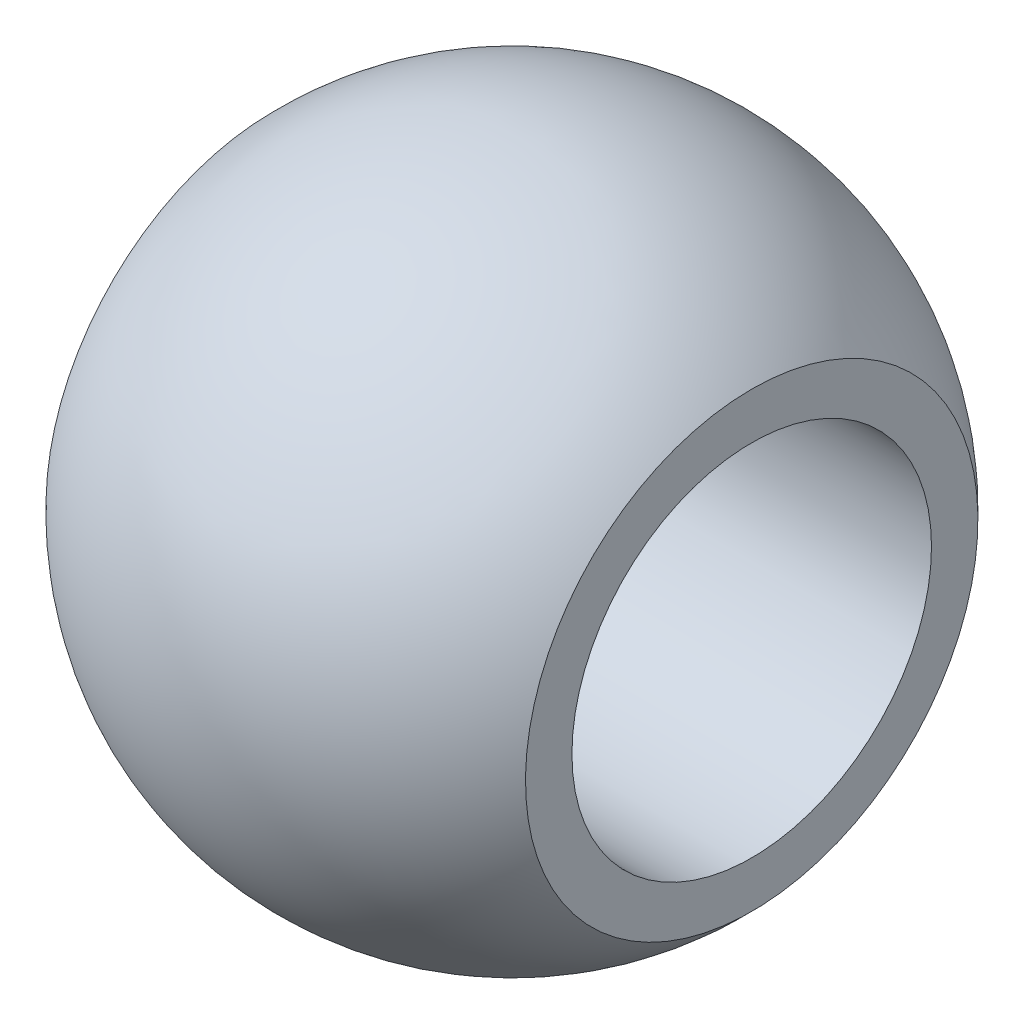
ISO-10303-21;
HEADER;
FILE_DESCRIPTION(('STEP AP214'),'2;1');
FILE_NAME('part.step','',(''),(''),'','','');
FILE_SCHEMA(('AUTOMOTIVE_DESIGN { 1 0 10303 214 1 1 1 1 }'));
ENDSEC;
DATA;
#1=APPLICATION_CONTEXT('core data for automotive mechanical design processes');
#2=APPLICATION_PROTOCOL_DEFINITION('international standard','automotive_design',2000,#1);
#3=PRODUCT_CONTEXT('',#1,'mechanical');
#4=PRODUCT('Part','Part','',(#3));
#5=PRODUCT_RELATED_PRODUCT_CATEGORY('part','',(#4));
#6=PRODUCT_DEFINITION_FORMATION('','',#4);
#7=PRODUCT_DEFINITION_CONTEXT('part definition',#1,'design');
#8=PRODUCT_DEFINITION('design','',#6,#7);
#9=PRODUCT_DEFINITION_SHAPE('','',#8);
#10=(LENGTH_UNIT() NAMED_UNIT(*) SI_UNIT(.MILLI.,.METRE.));
#11=(NAMED_UNIT(*) PLANE_ANGLE_UNIT() SI_UNIT($,.RADIAN.));
#12=(NAMED_UNIT(*) SI_UNIT($,.STERADIAN.) SOLID_ANGLE_UNIT());
#13=UNCERTAINTY_MEASURE_WITH_UNIT(LENGTH_MEASURE(1.E-05),#10,'distance_accuracy_value','');
#14=(GEOMETRIC_REPRESENTATION_CONTEXT(3) GLOBAL_UNCERTAINTY_ASSIGNED_CONTEXT((#13)) GLOBAL_UNIT_ASSIGNED_CONTEXT((#10,
#11,#12)) REPRESENTATION_CONTEXT('',''));
#15=CARTESIAN_POINT('',(0.,0.,0.));
#16=DIRECTION('',(0.,0.,1.));
#17=DIRECTION('',(1.,0.,0.));
#18=AXIS2_PLACEMENT_3D('',#15,#16,#17);
#19=CARTESIAN_POINT('',(0.,0.,0.));
#20=DIRECTION('',(1.,0.,0.));
#21=DIRECTION('',(0.,1.,0.));
#22=AXIS2_PLACEMENT_3D('',#19,#20,#21);
#23=SPHERICAL_SURFACE('',#22,11.);
#24=CARTESIAN_POINT('',(-8.,0.,0.));
#25=DIRECTION('',(1.,0.,0.));
#26=DIRECTION('',(0.,0.,-1.));
#27=AXIS2_PLACEMENT_3D('',#24,#25,#26);
#28=CIRCLE('',#27,7.54983443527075);
#29=CARTESIAN_POINT('',(-8.,7.54983443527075,0.));
#30=VERTEX_POINT('',#29);
#31=EDGE_CURVE('E10',#30,#30,#28,.T.);
#32=CARTESIAN_POINT('',(7.99999999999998,0.,0.));
#33=DIRECTION('',(1.,0.,0.));
#34=DIRECTION('',(0.,0.,-1.));
#35=AXIS2_PLACEMENT_3D('',#32,#33,#34);
#36=CIRCLE('',#35,7.54983443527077);
#37=CARTESIAN_POINT('',(7.99999999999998,7.54983443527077,0.));
#38=VERTEX_POINT('',#37);
#39=EDGE_CURVE('E46',#38,#38,#36,.T.);
#40=CARTESIAN_POINT('',(-8.,7.54983443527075,0.));
#41=CARTESIAN_POINT('',(-7.87191698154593,7.68556094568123,0.));
#42=CARTESIAN_POINT('',(-7.74037402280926,7.81802167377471,0.));
#43=CARTESIAN_POINT('',(-7.47072231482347,8.07608252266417,0.));
#44=CARTESIAN_POINT('',(-7.33261356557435,8.20168264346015,0.));
#45=CARTESIAN_POINT('',(-7.05018436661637,8.44569323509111,0.));
#46=CARTESIAN_POINT('',(-6.90586391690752,8.56410370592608,0.));
#47=CARTESIAN_POINT('',(-6.6113860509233,8.79342933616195,0.));
#48=CARTESIAN_POINT('',(-6.46122863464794,8.90434449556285,0.));
#49=CARTESIAN_POINT('',(-6.15546546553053,9.11839197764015,0.));
#50=CARTESIAN_POINT('',(-5.99985971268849,9.22152430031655,0.));
#51=CARTESIAN_POINT('',(-5.68360293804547,9.41973908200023,0.));
#52=CARTESIAN_POINT('',(-5.52295191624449,9.51482154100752,0.));
#53=CARTESIAN_POINT('',(-5.19702065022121,9.69669032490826,0.));
#54=CARTESIAN_POINT('',(-5.03174040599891,9.78347664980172,0.));
#55=CARTESIAN_POINT('',(-4.69697875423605,9.94852840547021,0.));
#56=CARTESIAN_POINT('',(-4.52749734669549,10.0267938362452,0.));
#57=CARTESIAN_POINT('',(-4.18477230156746,10.1746011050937,0.));
#58=CARTESIAN_POINT('',(-4.01152866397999,10.2441429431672,0.));
#59=CARTESIAN_POINT('',(-3.6617278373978,10.3743229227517,0.));
#60=CARTESIAN_POINT('',(-3.48517064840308,10.4349610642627,0.));
#61=CARTESIAN_POINT('',(-3.12919997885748,10.5471766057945,0.));
#62=CARTESIAN_POINT('',(-2.94978649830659,10.5987540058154,0.));
#63=CARTESIAN_POINT('',(-2.58856790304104,10.6927144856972,0.));
#64=CARTESIAN_POINT('',(-2.40676278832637,10.7350975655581,0.));
#65=CARTESIAN_POINT('',(-2.04123177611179,10.8105596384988,0.));
#66=CARTESIAN_POINT('',(-1.85750587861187,10.8436386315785,0.));
#67=CARTESIAN_POINT('',(-1.48860912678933,10.9004068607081,0.));
#68=CARTESIAN_POINT('',(-1.30343827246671,10.924096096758,0.));
#69=CARTESIAN_POINT('',(-0.932131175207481,10.9620234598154,0.));
#70=CARTESIAN_POINT('',(-0.74599493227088,10.9762615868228,0.));
#71=CARTESIAN_POINT('',(-0.373239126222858,10.9952498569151,0.));
#72=CARTESIAN_POINT('',(-0.186619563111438,11.,0.));
#73=CARTESIAN_POINT('',(0.186619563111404,11.,0.));
#74=CARTESIAN_POINT('',(0.373239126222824,10.9952498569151,0.));
#75=CARTESIAN_POINT('',(0.745994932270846,10.9762615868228,0.));
#76=CARTESIAN_POINT('',(0.932131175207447,10.9620234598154,0.));
#77=CARTESIAN_POINT('',(1.30343827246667,10.924096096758,0.));
#78=CARTESIAN_POINT('',(1.4886091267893,10.9004068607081,0.));
#79=CARTESIAN_POINT('',(1.85750587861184,10.8436386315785,0.));
#80=CARTESIAN_POINT('',(2.04123177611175,10.8105596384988,0.));
#81=CARTESIAN_POINT('',(2.40676278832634,10.7350975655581,0.));
#82=CARTESIAN_POINT('',(2.588567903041,10.6927144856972,0.));
#83=CARTESIAN_POINT('',(2.94978649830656,10.5987540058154,0.));
#84=CARTESIAN_POINT('',(3.12919997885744,10.5471766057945,0.));
#85=CARTESIAN_POINT('',(3.48517064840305,10.4349610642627,0.));
#86=CARTESIAN_POINT('',(3.66172783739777,10.3743229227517,0.));
#87=CARTESIAN_POINT('',(4.01152866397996,10.2441429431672,0.));
#88=CARTESIAN_POINT('',(4.18477230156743,10.1746011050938,0.));
#89=CARTESIAN_POINT('',(4.52749734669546,10.0267938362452,0.));
#90=CARTESIAN_POINT('',(4.69697875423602,9.94852840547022,0.));
#91=CARTESIAN_POINT('',(5.03174040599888,9.78347664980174,0.));
#92=CARTESIAN_POINT('',(5.19702065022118,9.69669032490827,0.));
#93=CARTESIAN_POINT('',(5.52295191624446,9.51482154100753,0.));
#94=CARTESIAN_POINT('',(5.68360293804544,9.41973908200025,0.));
#95=CARTESIAN_POINT('',(5.99985971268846,9.22152430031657,0.));
#96=CARTESIAN_POINT('',(6.15546546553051,9.11839197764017,0.));
#97=CARTESIAN_POINT('',(6.46122863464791,8.90434449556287,0.));
#98=CARTESIAN_POINT('',(6.61138605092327,8.79342933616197,0.));
#99=CARTESIAN_POINT('',(6.90586391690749,8.5641037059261,0.));
#100=CARTESIAN_POINT('',(7.05018436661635,8.44569323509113,0.));
#101=CARTESIAN_POINT('',(7.33261356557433,8.20168264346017,0.));
#102=CARTESIAN_POINT('',(7.47072231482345,8.07608252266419,0.));
#103=CARTESIAN_POINT('',(7.74037402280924,7.81802167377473,0.));
#104=CARTESIAN_POINT('',(7.8719169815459,7.68556094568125,0.));
#105=CARTESIAN_POINT('',(7.99999999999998,7.54983443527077,0.));
#106=B_SPLINE_CURVE_WITH_KNOTS('',3,(#40,#41,#42,#43,#44,#45,#46,#47,#48,#49,#50,#51,#52,#53,
#54,#55,#56,#57,#58,#59,#60,#61,#62,#63,#64,#65,#66,#67,#68,#69,#70,#71,#72,#73,#74,#75,#76,#77,
#78,#79,#80,#81,#82,#83,#84,#85,#86,#87,#88,#89,#90,#91,#92,#93,#94,#95,#96,#97,#98,#99,#100,
#101,#102,#103,#104,#105),.UNSPECIFIED.,.F.,.F.,(4,2,2,2,2,2,2,2,2,2,2,2,2,2,2,2,2,2,2,2,2,2,2,
2,2,2,2,2,2,2,2,2,4),(0.,0.559798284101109,1.11959656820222,1.67939485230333,2.23919313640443,
2.79899142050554,3.35878970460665,3.91858798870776,4.47838627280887,5.03818455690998,
5.59798284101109,6.1577811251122,6.71757940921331,7.27737769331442,7.83717597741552,
8.39697426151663,8.95677254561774,9.51657082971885,10.07636911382,10.6361673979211,
11.1959656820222,11.7557639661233,12.3155622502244,12.8753605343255,13.4351588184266,
13.9949571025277,14.5547553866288,15.1145536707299,15.6743519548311,16.2341502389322,
16.7939485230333,17.3537468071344,17.9135450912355),.UNSPECIFIED.);
#107=EDGE_CURVE('BSEAM32',#30,#38,#106,.T.);
#108=ORIENTED_EDGE('',*,*,#31,.T.);
#109=ORIENTED_EDGE('',*,*,#39,.F.);
#110=ORIENTED_EDGE('',*,*,#107,.T.);
#111=ORIENTED_EDGE('',*,*,#107,.F.);
#112=EDGE_LOOP('',(#108,#110,#109,#111));
#113=FACE_BOUND('',#112,.T.);
#114=ADVANCED_FACE('F32',(#113),#23,.T.);
#115=CARTESIAN_POINT('',(-8.,7.54983443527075,0.));
#116=DIRECTION('',(-1.,0.,0.));
#117=DIRECTION('',(0.,0.,1.));
#118=AXIS2_PLACEMENT_3D('',#115,#116,#117);
#119=PLANE('',#118);
#120=CARTESIAN_POINT('',(-8.,0.,0.));
#121=DIRECTION('',(1.,0.,0.));
#122=DIRECTION('',(0.,0.,-1.));
#123=AXIS2_PLACEMENT_3D('',#120,#121,#122);
#124=CIRCLE('',#123,6.);
#125=CARTESIAN_POINT('',(-8.,0.,-6.));
#126=VERTEX_POINT('',#125);
#127=EDGE_CURVE('E38',#126,#126,#124,.T.);
#128=ORIENTED_EDGE('',*,*,#127,.T.);
#129=EDGE_LOOP('',(#128));
#130=FACE_BOUND('',#129,.T.);
#131=ORIENTED_EDGE('',*,*,#31,.F.);
#132=EDGE_LOOP('',(#131));
#133=FACE_BOUND('',#132,.T.);
#134=ADVANCED_FACE('F56',(#130,#133),#119,.T.);
#135=CARTESIAN_POINT('',(0.,0.,0.));
#136=DIRECTION('',(1.,0.,0.));
#137=DIRECTION('',(0.,0.,-1.));
#138=AXIS2_PLACEMENT_3D('',#135,#136,#137);
#139=CYLINDRICAL_SURFACE('',#138,6.);
#140=CARTESIAN_POINT('',(8.,0.,0.));
#141=DIRECTION('',(1.,0.,0.));
#142=DIRECTION('',(0.,0.,-1.));
#143=AXIS2_PLACEMENT_3D('',#140,#141,#142);
#144=CIRCLE('',#143,6.);
#145=CARTESIAN_POINT('',(8.,0.,-6.));
#146=VERTEX_POINT('',#145);
#147=EDGE_CURVE('E42',#146,#146,#144,.T.);
#148=ORIENTED_EDGE('',*,*,#147,.T.);
#149=EDGE_LOOP('',(#148));
#150=FACE_BOUND('',#149,.T.);
#151=ORIENTED_EDGE('',*,*,#127,.F.);
#152=EDGE_LOOP('',(#151));
#153=FACE_BOUND('',#152,.T.);
#154=ADVANCED_FACE('F60',(#150,#153),#139,.F.);
#155=CARTESIAN_POINT('',(7.99999999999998,7.54983443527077,0.));
#156=DIRECTION('',(1.,0.,0.));
#157=DIRECTION('',(0.,0.,-1.));
#158=AXIS2_PLACEMENT_3D('',#155,#156,#157);
#159=PLANE('',#158);
#160=ORIENTED_EDGE('',*,*,#39,.T.);
#161=EDGE_LOOP('',(#160));
#162=FACE_BOUND('',#161,.T.);
#163=ORIENTED_EDGE('',*,*,#147,.F.);
#164=EDGE_LOOP('',(#163));
#165=FACE_BOUND('',#164,.T.);
#166=ADVANCED_FACE('F52',(#162,#165),#159,.T.);
#167=CLOSED_SHELL('',(#114,#134,#154,#166));
#168=MANIFOLD_SOLID_BREP('B2',#167);
#169=ADVANCED_BREP_SHAPE_REPRESENTATION('',(#18,#168),#14);
#170=SHAPE_DEFINITION_REPRESENTATION(#9,#169);
ENDSEC;
END-ISO-10303-21;
